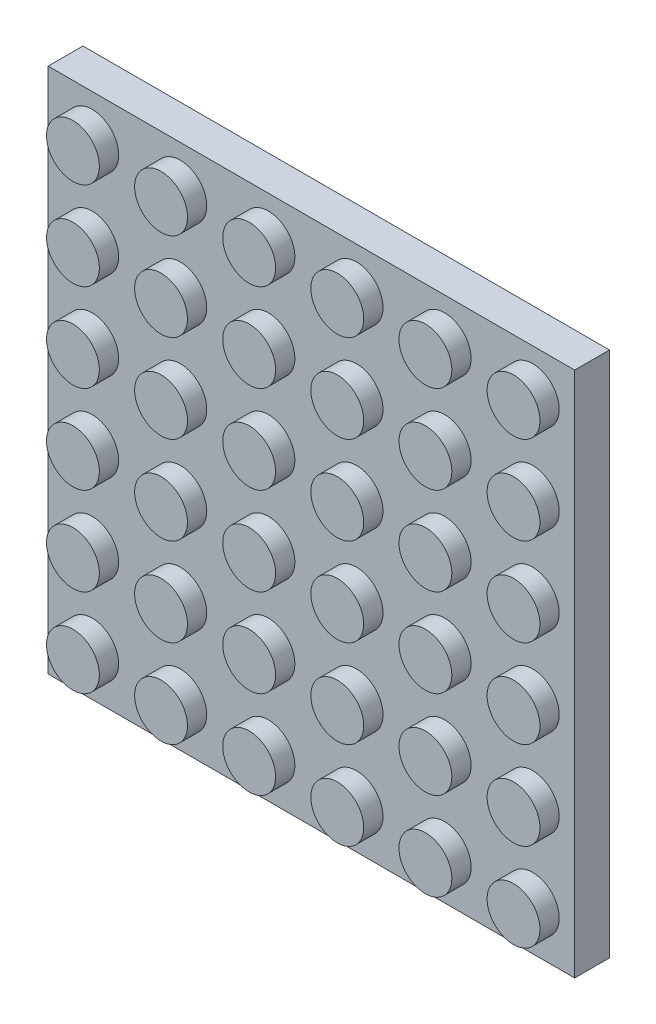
from build123d import *

# Parameters (mm, degrees)
SKETCH_1_W                  = 47.8
SKETCH_1_H                  = 47.8
EXTRUDE_3387_DEPTH          = 3.16
SKETCH_2_R                  = 2.4
EXTRUDE_1_DEPTH             = 1.75
PATTERN_LINEAR_1_COUNT      = 6
PATTERN_LINEAR_1_PITCH      = 8
PATTERN_LINEAR_1_COUNT_DIR2 = 6
PATTERN_LINEAR_1_PITCH_DIR2 = 8
SKETCH_3_W                  = 44.8
SKETCH_3_H                  = 44.8
CUT_EXTRUDE_1_DEPTH         = 2
SKETCH_4_R                  = 3.25
SKETCH_4_R_2                = 2.5
EXTRUDE_2_DEPTH             = 2
SKETCH_5_R                  = 1.25
CUT_EXTRUDE_2_DEPTH         = 2
PATTERN_LINEAR_2_COUNT      = 6
PATTERN_LINEAR_2_PITCH      = 8
PATTERN_LINEAR_2_COUNT_DIR2 = 10
PATTERN_LINEAR_2_PITCH_DIR2 = 8
PATTERN_LINEAR_3_COUNT      = 5
PATTERN_LINEAR_3_PITCH      = 8
PATTERN_LINEAR_3_COUNT_DIR2 = 5
PATTERN_LINEAR_3_PITCH_DIR2 = 8


with BuildPart() as part:
    # Sketch 1 → Extrude 3387 (new body)
    with BuildSketch(Plane(origin=(0.007312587, -0.1312965, 0), x_dir=(1, 0, 0), z_dir=(0, 0, 1))):
        with Locations((15.315083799, -15.900418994)):
            Rectangle(SKETCH_1_W, SKETCH_1_H)
    extrude(amount=-EXTRUDE_3387_DEPTH)

    # Sketch 2 → Extrude 1 (add)
    with BuildSketch(Plane.XY):
        with Locations((-4.577603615, -35.931715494)):
            Circle(SKETCH_2_R)
    extrude_1 = extrude(amount=EXTRUDE_1_DEPTH)

    # Pattern Linear 1: Extrude 1 6 × 6
    with Locations(*[(i * PATTERN_LINEAR_1_PITCH, j * PATTERN_LINEAR_1_PITCH_DIR2, 0) for i in range(PATTERN_LINEAR_1_COUNT) for j in range(PATTERN_LINEAR_1_COUNT_DIR2) if (i, j) != (0, 0)]):
        add(extrude_1)

    # Sketch 3 → Cut-Extrude 1 (cut)
    with BuildSketch(Plane(origin=(0, 0, -3.16), x_dir=(-1, 0, 0), z_dir=(0, 0, -1))):
        with Locations((-15.322396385, -16.031715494)):
            Rectangle(SKETCH_3_W, SKETCH_3_H)
    extrude(amount=-CUT_EXTRUDE_1_DEPTH, mode=Mode.SUBTRACT)

    # Sketch 4 → Extrude 2 (add)
    with BuildSketch(Plane(origin=(0, 0, -1.16), x_dir=(-1, 0, 0), z_dir=(0, 0, -1))):
        with Locations((0.577603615, -31.931715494)):
            Circle(SKETCH_4_R)
        with Locations((0.577603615, -31.931715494)):
            Circle(SKETCH_4_R_2, mode=Mode.SUBTRACT)
    extrude_2 = extrude(amount=EXTRUDE_2_DEPTH)

    # Sketch 5 → Cut-Extrude 2 (cut)
    with BuildSketch(Plane(origin=(0, 0, -1.16), x_dir=(-1, 0, 0), z_dir=(0, 0, -1))):
        with Locations((-35.222396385, -35.931715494)):
            Circle(SKETCH_5_R)
    cut_extrude_2 = extrude(amount=-CUT_EXTRUDE_2_DEPTH, mode=Mode.SUBTRACT)

    # Pattern Linear 2: Cut-Extrude 2 6 × 10
    with Locations(*[(-i * PATTERN_LINEAR_2_PITCH, j * PATTERN_LINEAR_2_PITCH_DIR2, 0) for i in range(PATTERN_LINEAR_2_COUNT) for j in range(PATTERN_LINEAR_2_COUNT_DIR2) if (i, j) != (0, 0)]):
        add(cut_extrude_2, mode=Mode.SUBTRACT)

    # Pattern Linear 3: Extrude 2 5 × 5
    with Locations(*[(j * PATTERN_LINEAR_3_PITCH_DIR2, i * PATTERN_LINEAR_3_PITCH, 0) for i in range(PATTERN_LINEAR_3_COUNT) for j in range(PATTERN_LINEAR_3_COUNT_DIR2) if (i, j) != (0, 0)]):
        add(extrude_2)


solid = part.part
